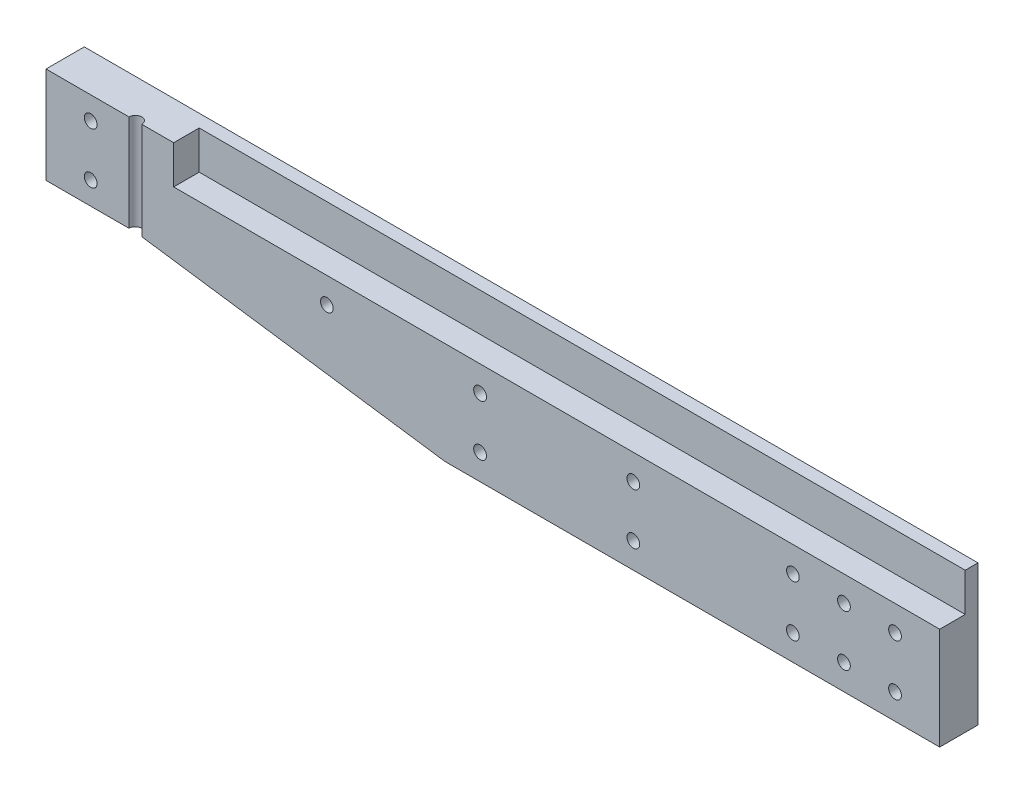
ISO-10303-21;
HEADER;
FILE_DESCRIPTION(('STEP AP214'),'2;1');
FILE_NAME('part.step','',(''),(''),'','','');
FILE_SCHEMA(('AUTOMOTIVE_DESIGN { 1 0 10303 214 1 1 1 1 }'));
ENDSEC;
DATA;
#1=APPLICATION_CONTEXT('core data for automotive mechanical design processes');
#2=APPLICATION_PROTOCOL_DEFINITION('international standard','automotive_design',2000,#1);
#3=PRODUCT_CONTEXT('',#1,'mechanical');
#4=PRODUCT('Part','Part','',(#3));
#5=PRODUCT_RELATED_PRODUCT_CATEGORY('part','',(#4));
#6=PRODUCT_DEFINITION_FORMATION('','',#4);
#7=PRODUCT_DEFINITION_CONTEXT('part definition',#1,'design');
#8=PRODUCT_DEFINITION('design','',#6,#7);
#9=PRODUCT_DEFINITION_SHAPE('','',#8);
#10=(LENGTH_UNIT() NAMED_UNIT(*) SI_UNIT(.MILLI.,.METRE.));
#11=(NAMED_UNIT(*) PLANE_ANGLE_UNIT() SI_UNIT($,.RADIAN.));
#12=(NAMED_UNIT(*) SI_UNIT($,.STERADIAN.) SOLID_ANGLE_UNIT());
#13=UNCERTAINTY_MEASURE_WITH_UNIT(LENGTH_MEASURE(1.E-05),#10,'distance_accuracy_value','');
#14=(GEOMETRIC_REPRESENTATION_CONTEXT(3) GLOBAL_UNCERTAINTY_ASSIGNED_CONTEXT((#13)) GLOBAL_UNIT_ASSIGNED_CONTEXT((#10,
#11,#12)) REPRESENTATION_CONTEXT('',''));
#15=CARTESIAN_POINT('',(0.,0.,0.));
#16=DIRECTION('',(0.,0.,1.));
#17=DIRECTION('',(1.,0.,0.));
#18=AXIS2_PLACEMENT_3D('',#15,#16,#17);
#19=CARTESIAN_POINT('',(-629.274019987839,69.85,-38.1000000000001));
#20=DIRECTION('',(0.,0.,1.));
#21=DIRECTION('',(1.,0.,0.));
#22=AXIS2_PLACEMENT_3D('',#19,#20,#21);
#23=PLANE('',#22);
#24=CARTESIAN_POINT('',(-422.275,33.1531451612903,-38.1));
#25=DIRECTION('',(0.,0.,-1.));
#26=DIRECTION('',(-1.,0.,0.));
#27=AXIS2_PLACEMENT_3D('',#24,#25,#26);
#28=CIRCLE('',#27,3.17499999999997);
#29=CARTESIAN_POINT('',(-425.45,33.1531451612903,-38.1));
#30=VERTEX_POINT('',#29);
#31=EDGE_CURVE('E412',#30,#30,#28,.T.);
#32=ORIENTED_EDGE('',*,*,#31,.F.);
#33=EDGE_LOOP('',(#32));
#34=FACE_BOUND('',#33,.T.);
#35=CARTESIAN_POINT('',(-422.275,58.5531451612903,-38.1));
#36=DIRECTION('',(0.,0.,-1.));
#37=DIRECTION('',(-1.,0.,0.));
#38=AXIS2_PLACEMENT_3D('',#35,#36,#37);
#39=CIRCLE('',#38,3.17499999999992);
#40=CARTESIAN_POINT('',(-425.45,58.5531451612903,-38.1));
#41=VERTEX_POINT('',#40);
#42=EDGE_CURVE('E265',#41,#41,#39,.T.);
#43=ORIENTED_EDGE('',*,*,#42,.F.);
#44=EDGE_LOOP('',(#43));
#45=FACE_BOUND('',#44,.T.);
#46=CARTESIAN_POINT('',(-228.6,38.1,-38.1));
#47=DIRECTION('',(0.,0.,1.));
#48=DIRECTION('',(1.,0.,0.));
#49=AXIS2_PLACEMENT_3D('',#46,#47,#48);
#50=CIRCLE('',#49,3.175);
#51=CARTESIAN_POINT('',(-225.425,38.1,-38.1));
#52=VERTEX_POINT('',#51);
#53=EDGE_CURVE('E163',#52,#52,#50,.T.);
#54=ORIENTED_EDGE('',*,*,#53,.T.);
#55=EDGE_LOOP('',(#54));
#56=FACE_BOUND('',#55,.T.);
#57=CARTESIAN_POINT('',(-228.6,12.7,-38.1));
#58=DIRECTION('',(0.,0.,1.));
#59=DIRECTION('',(1.,0.,0.));
#60=AXIS2_PLACEMENT_3D('',#57,#58,#59);
#61=CIRCLE('',#60,3.175);
#62=CARTESIAN_POINT('',(-225.425,12.7,-38.1));
#63=VERTEX_POINT('',#62);
#64=EDGE_CURVE('E169',#63,#63,#61,.T.);
#65=ORIENTED_EDGE('',*,*,#64,.T.);
#66=EDGE_LOOP('',(#65));
#67=FACE_BOUND('',#66,.T.);
#68=CARTESIAN_POINT('',(-152.4,38.1,-38.1));
#69=DIRECTION('',(0.,0.,1.));
#70=DIRECTION('',(1.,0.,0.));
#71=AXIS2_PLACEMENT_3D('',#68,#69,#70);
#72=CIRCLE('',#71,3.175);
#73=CARTESIAN_POINT('',(-149.225,38.1,-38.1));
#74=VERTEX_POINT('',#73);
#75=EDGE_CURVE('E175',#74,#74,#72,.T.);
#76=ORIENTED_EDGE('',*,*,#75,.T.);
#77=EDGE_LOOP('',(#76));
#78=FACE_BOUND('',#77,.T.);
#79=CARTESIAN_POINT('',(-22.225,38.1,-38.1));
#80=DIRECTION('',(0.,0.,1.));
#81=DIRECTION('',(1.,0.,0.));
#82=AXIS2_PLACEMENT_3D('',#79,#80,#81);
#83=CIRCLE('',#82,3.175);
#84=CARTESIAN_POINT('',(-19.05,38.1,-38.1));
#85=VERTEX_POINT('',#84);
#86=EDGE_CURVE('E181',#85,#85,#83,.T.);
#87=ORIENTED_EDGE('',*,*,#86,.T.);
#88=EDGE_LOOP('',(#87));
#89=FACE_BOUND('',#88,.T.);
#90=CARTESIAN_POINT('',(-47.625,12.7,-38.1));
#91=DIRECTION('',(0.,0.,1.));
#92=DIRECTION('',(1.,0.,0.));
#93=AXIS2_PLACEMENT_3D('',#90,#91,#92);
#94=CIRCLE('',#93,3.175);
#95=CARTESIAN_POINT('',(-44.45,12.7,-38.1));
#96=VERTEX_POINT('',#95);
#97=EDGE_CURVE('E187',#96,#96,#94,.T.);
#98=ORIENTED_EDGE('',*,*,#97,.T.);
#99=EDGE_LOOP('',(#98));
#100=FACE_BOUND('',#99,.T.);
#101=CARTESIAN_POINT('',(-73.025,38.1,-38.1));
#102=DIRECTION('',(0.,0.,1.));
#103=DIRECTION('',(1.,0.,0.));
#104=AXIS2_PLACEMENT_3D('',#101,#102,#103);
#105=CIRCLE('',#104,3.14960000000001);
#106=CARTESIAN_POINT('',(-69.8754,38.1,-38.1));
#107=VERTEX_POINT('',#106);
#108=EDGE_CURVE('E193',#107,#107,#105,.T.);
#109=ORIENTED_EDGE('',*,*,#108,.T.);
#110=EDGE_LOOP('',(#109));
#111=FACE_BOUND('',#110,.T.);
#112=CARTESIAN_POINT('',(-73.025,12.7,-38.1));
#113=DIRECTION('',(0.,0.,1.));
#114=DIRECTION('',(1.,0.,0.));
#115=AXIS2_PLACEMENT_3D('',#112,#113,#114);
#116=CIRCLE('',#115,3.175);
#117=CARTESIAN_POINT('',(-69.85,12.7,-38.1));
#118=VERTEX_POINT('',#117);
#119=EDGE_CURVE('E190',#118,#118,#116,.T.);
#120=ORIENTED_EDGE('',*,*,#119,.T.);
#121=EDGE_LOOP('',(#120));
#122=FACE_BOUND('',#121,.T.);
#123=CARTESIAN_POINT('',(-47.625,38.1,-38.1));
#124=DIRECTION('',(0.,0.,1.));
#125=DIRECTION('',(1.,0.,0.));
#126=AXIS2_PLACEMENT_3D('',#123,#124,#125);
#127=CIRCLE('',#126,3.175);
#128=CARTESIAN_POINT('',(-44.45,38.1,-38.1));
#129=VERTEX_POINT('',#128);
#130=EDGE_CURVE('E184',#129,#129,#127,.T.);
#131=ORIENTED_EDGE('',*,*,#130,.T.);
#132=EDGE_LOOP('',(#131));
#133=FACE_BOUND('',#132,.T.);
#134=CARTESIAN_POINT('',(-22.225,12.7,-38.1));
#135=DIRECTION('',(0.,0.,1.));
#136=DIRECTION('',(1.,0.,0.));
#137=AXIS2_PLACEMENT_3D('',#134,#135,#136);
#138=CIRCLE('',#137,3.175);
#139=CARTESIAN_POINT('',(-19.05,12.7,-38.1));
#140=VERTEX_POINT('',#139);
#141=EDGE_CURVE('E178',#140,#140,#138,.T.);
#142=ORIENTED_EDGE('',*,*,#141,.T.);
#143=EDGE_LOOP('',(#142));
#144=FACE_BOUND('',#143,.T.);
#145=CARTESIAN_POINT('',(-152.4,12.7,-38.1));
#146=DIRECTION('',(0.,0.,1.));
#147=DIRECTION('',(1.,0.,0.));
#148=AXIS2_PLACEMENT_3D('',#145,#146,#147);
#149=CIRCLE('',#148,3.175);
#150=CARTESIAN_POINT('',(-149.225,12.7,-38.1));
#151=VERTEX_POINT('',#150);
#152=EDGE_CURVE('E172',#151,#151,#149,.T.);
#153=ORIENTED_EDGE('',*,*,#152,.T.);
#154=EDGE_LOOP('',(#153));
#155=FACE_BOUND('',#154,.T.);
#156=CARTESIAN_POINT('',(-304.8,38.1,-38.1));
#157=DIRECTION('',(0.,0.,1.));
#158=DIRECTION('',(1.,0.,0.));
#159=AXIS2_PLACEMENT_3D('',#156,#157,#158);
#160=CIRCLE('',#159,3.17499999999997);
#161=CARTESIAN_POINT('',(-301.625,38.1,-38.1));
#162=VERTEX_POINT('',#161);
#163=EDGE_CURVE('E166',#162,#162,#160,.T.);
#164=ORIENTED_EDGE('',*,*,#163,.T.);
#165=EDGE_LOOP('',(#164));
#166=FACE_BOUND('',#165,.T.);
#167=DIRECTION('',(0.,1.,0.));
#168=VECTOR('',#167,1.);
#169=CARTESIAN_POINT('',(-444.5,21.8562903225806,-38.1));
#170=LINE('',#169,#168);
#171=CARTESIAN_POINT('',(-444.5,21.8562903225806,-38.1));
#172=VERTEX_POINT('',#171);
#173=CARTESIAN_POINT('',(-444.5,69.85,-38.1));
#174=VERTEX_POINT('',#173);
#175=EDGE_CURVE('E50',#172,#174,#170,.T.);
#176=ORIENTED_EDGE('',*,*,#175,.T.);
#177=DIRECTION('',(-1.,0.,0.));
#178=VECTOR('',#177,1.);
#179=CARTESIAN_POINT('',(-629.274019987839,69.85,-38.1000000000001));
#180=LINE('',#179,#178);
#181=CARTESIAN_POINT('',(0.,69.85,-38.1));
#182=VERTEX_POINT('',#181);
#183=EDGE_CURVE('E227',#182,#174,#180,.T.);
#184=ORIENTED_EDGE('',*,*,#183,.F.);
#185=DIRECTION('',(0.,-1.,0.));
#186=VECTOR('',#185,1.);
#187=CARTESIAN_POINT('',(0.,69.85,-38.1));
#188=LINE('',#187,#186);
#189=CARTESIAN_POINT('',(0.,0.,-38.1));
#190=VERTEX_POINT('',#189);
#191=EDGE_CURVE('E235',#182,#190,#188,.T.);
#192=ORIENTED_EDGE('',*,*,#191,.T.);
#193=DIRECTION('',(-1.,0.,0.));
#194=VECTOR('',#193,1.);
#195=CARTESIAN_POINT('',(-629.274019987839,0.,-38.1000000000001));
#196=LINE('',#195,#194);
#197=CARTESIAN_POINT('',(-246.0625,0.,-38.1));
#198=VERTEX_POINT('',#197);
#199=EDGE_CURVE('E226',#190,#198,#196,.T.);
#200=ORIENTED_EDGE('',*,*,#199,.T.);
#201=DIRECTION('',(0.990076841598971,-0.14052703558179,0.));
#202=VECTOR('',#201,1.);
#203=CARTESIAN_POINT('',(-631.424826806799,54.696588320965,-38.1000000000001));
#204=LINE('',#203,#202);
#205=CARTESIAN_POINT('',(-400.05,21.8562903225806,-38.1));
#206=VERTEX_POINT('',#205);
#207=EDGE_CURVE('E221',#206,#198,#204,.T.);
#208=ORIENTED_EDGE('',*,*,#207,.F.);
#209=DIRECTION('',(1.,0.,0.));
#210=VECTOR('',#209,1.);
#211=CARTESIAN_POINT('',(-444.5,21.8562903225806,-38.1));
#212=LINE('',#211,#210);
#213=EDGE_CURVE('E211',#172,#206,#212,.T.);
#214=ORIENTED_EDGE('',*,*,#213,.F.);
#215=EDGE_LOOP('',(#176,#184,#192,#200,#208,#214));
#216=FACE_BOUND('',#215,.T.);
#217=ADVANCED_FACE('F35',(#34,#45,#56,#67,#78,#89,#100,#111,#122,#133,#144,#155,#166,#216),#23,.F.);
#218=CARTESIAN_POINT('',(-629.274019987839,69.85,-9.52499999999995));
#219=DIRECTION('',(0.,1.,0.));
#220=DIRECTION('',(0.,0.,1.));
#221=AXIS2_PLACEMENT_3D('',#218,#219,#220);
#222=PLANE('',#221);
#223=ORIENTED_EDGE('',*,*,#183,.T.);
#224=DIRECTION('',(0.,0.,-1.));
#225=VECTOR('',#224,1.);
#226=CARTESIAN_POINT('',(-444.5,69.85,626.540370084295));
#227=LINE('',#226,#225);
#228=CARTESIAN_POINT('',(-444.5,69.85,-19.05));
#229=VERTEX_POINT('',#228);
#230=EDGE_CURVE('E263',#229,#174,#227,.T.);
#231=ORIENTED_EDGE('',*,*,#230,.F.);
#232=DIRECTION('',(-1.,0.,0.));
#233=VECTOR('',#232,1.);
#234=CARTESIAN_POINT('',(-629.274019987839,69.85,-19.05));
#235=LINE('',#234,#233);
#236=CARTESIAN_POINT('',(-403.225,69.85,-19.05));
#237=VERTEX_POINT('',#236);
#238=EDGE_CURVE('E229',#237,#229,#235,.T.);
#239=ORIENTED_EDGE('',*,*,#238,.F.);
#240=CARTESIAN_POINT('',(-400.05,69.85,-19.05));
#241=DIRECTION('',(0.,1.,0.));
#242=DIRECTION('',(0.,0.,1.));
#243=AXIS2_PLACEMENT_3D('',#240,#241,#242);
#244=CIRCLE('',#243,3.17499999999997);
#245=CARTESIAN_POINT('',(-396.875,69.85,-19.05));
#246=VERTEX_POINT('',#245);
#247=EDGE_CURVE('E138',#246,#237,#244,.T.);
#248=ORIENTED_EDGE('',*,*,#247,.F.);
#249=DIRECTION('',(-1.,0.,0.));
#250=VECTOR('',#249,1.);
#251=CARTESIAN_POINT('',(-629.274019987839,69.85,-19.05));
#252=LINE('',#251,#250);
#253=CARTESIAN_POINT('',(-381.,69.85,-19.05));
#254=VERTEX_POINT('',#253);
#255=EDGE_CURVE('E134',#254,#246,#252,.T.);
#256=ORIENTED_EDGE('',*,*,#255,.F.);
#257=DIRECTION('',(0.,0.,1.));
#258=VECTOR('',#257,1.);
#259=CARTESIAN_POINT('',(-381.,69.85,-19.05));
#260=LINE('',#259,#258);
#261=CARTESIAN_POINT('',(-381.,69.85,-31.75));
#262=VERTEX_POINT('',#261);
#263=EDGE_CURVE('E118',#262,#254,#260,.T.);
#264=ORIENTED_EDGE('',*,*,#263,.F.);
#265=DIRECTION('',(1.,0.,0.));
#266=VECTOR('',#265,1.);
#267=CARTESIAN_POINT('',(-381.,69.85,-31.75));
#268=LINE('',#267,#266);
#269=CARTESIAN_POINT('',(0.,69.85,-31.75));
#270=VERTEX_POINT('',#269);
#271=EDGE_CURVE('E219',#262,#270,#268,.T.);
#272=ORIENTED_EDGE('',*,*,#271,.T.);
#273=DIRECTION('',(0.,0.,1.));
#274=VECTOR('',#273,1.);
#275=CARTESIAN_POINT('',(0.,69.85,-28.575));
#276=LINE('',#275,#274);
#277=EDGE_CURVE('E232',#182,#270,#276,.T.);
#278=ORIENTED_EDGE('',*,*,#277,.F.);
#279=EDGE_LOOP('',(#223,#231,#239,#248,#256,#264,#272,#278));
#280=FACE_BOUND('',#279,.T.);
#281=ADVANCED_FACE('F135',(#280),#222,.T.);
#282=CARTESIAN_POINT('',(-629.274019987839,69.85,-19.05));
#283=DIRECTION('',(0.,0.,1.));
#284=DIRECTION('',(1.,0.,0.));
#285=AXIS2_PLACEMENT_3D('',#282,#283,#284);
#286=PLANE('',#285);
#287=CARTESIAN_POINT('',(-422.275,33.1531451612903,-19.05));
#288=DIRECTION('',(0.,0.,1.));
#289=DIRECTION('',(1.,0.,0.));
#290=AXIS2_PLACEMENT_3D('',#287,#288,#289);
#291=CIRCLE('',#290,3.17499999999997);
#292=CARTESIAN_POINT('',(-419.1,33.1531451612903,-19.05));
#293=VERTEX_POINT('',#292);
#294=EDGE_CURVE('E409',#293,#293,#291,.F.);
#295=ORIENTED_EDGE('',*,*,#294,.T.);
#296=EDGE_LOOP('',(#295));
#297=FACE_BOUND('',#296,.T.);
#298=CARTESIAN_POINT('',(-422.275,58.5531451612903,-19.05));
#299=DIRECTION('',(0.,0.,1.));
#300=DIRECTION('',(1.,0.,0.));
#301=AXIS2_PLACEMENT_3D('',#298,#299,#300);
#302=CIRCLE('',#301,3.17499999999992);
#303=CARTESIAN_POINT('',(-419.1,58.5531451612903,-19.05));
#304=VERTEX_POINT('',#303);
#305=EDGE_CURVE('E271',#304,#304,#302,.F.);
#306=ORIENTED_EDGE('',*,*,#305,.T.);
#307=EDGE_LOOP('',(#306));
#308=FACE_BOUND('',#307,.T.);
#309=ORIENTED_EDGE('',*,*,#238,.T.);
#310=DIRECTION('',(0.,-1.,0.));
#311=VECTOR('',#310,1.);
#312=CARTESIAN_POINT('',(-444.5,21.8562903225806,-19.05));
#313=LINE('',#312,#311);
#314=CARTESIAN_POINT('',(-444.5,21.8562903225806,-19.05));
#315=VERTEX_POINT('',#314);
#316=EDGE_CURVE('E58',#229,#315,#313,.T.);
#317=ORIENTED_EDGE('',*,*,#316,.T.);
#318=DIRECTION('',(1.,0.,0.));
#319=VECTOR('',#318,1.);
#320=CARTESIAN_POINT('',(-444.5,21.8562903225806,-19.05));
#321=LINE('',#320,#319);
#322=CARTESIAN_POINT('',(-403.225,21.8562903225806,-19.05));
#323=VERTEX_POINT('',#322);
#324=EDGE_CURVE('E207',#315,#323,#321,.T.);
#325=ORIENTED_EDGE('',*,*,#324,.T.);
#326=DIRECTION('',(0.,1.,0.));
#327=VECTOR('',#326,1.);
#328=CARTESIAN_POINT('',(-403.225,-0.00100000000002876,-19.05));
#329=LINE('',#328,#327);
#330=EDGE_CURVE('E196',#237,#323,#329,.F.);
#331=ORIENTED_EDGE('',*,*,#330,.F.);
#332=EDGE_LOOP('',(#309,#317,#325,#331));
#333=FACE_BOUND('',#332,.T.);
#334=ADVANCED_FACE('F326',(#297,#308,#333),#286,.T.);
#335=CARTESIAN_POINT('',(-492.125,34.925,621.777870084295));
#336=DIRECTION('',(0.14052703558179,0.990076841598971,0.));
#337=DIRECTION('',(-0.990076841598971,0.14052703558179,0.));
#338=AXIS2_PLACEMENT_3D('',#335,#336,#337);
#339=PLANE('',#338);
#340=DIRECTION('',(0.,0.,-1.));
#341=VECTOR('',#340,1.);
#342=CARTESIAN_POINT('',(-246.0625,0.,-9.52499999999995));
#343=LINE('',#342,#341);
#344=CARTESIAN_POINT('',(-246.0625,0.,-19.05));
#345=VERTEX_POINT('',#344);
#346=EDGE_CURVE('E11',#345,#198,#343,.T.);
#347=ORIENTED_EDGE('',*,*,#346,.F.);
#348=DIRECTION('',(-0.990076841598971,0.14052703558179,0.));
#349=VECTOR('',#348,1.);
#350=CARTESIAN_POINT('',(-492.125,34.925,-19.05));
#351=LINE('',#350,#349);
#352=CARTESIAN_POINT('',(-396.875,21.4056451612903,-19.05));
#353=VERTEX_POINT('',#352);
#354=EDGE_CURVE('E161',#345,#353,#351,.T.);
#355=ORIENTED_EDGE('',*,*,#354,.T.);
#356=CARTESIAN_POINT('',(-400.05,21.8562903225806,-19.05));
#357=DIRECTION('',(0.14052703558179,0.990076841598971,0.));
#358=DIRECTION('',(-0.990076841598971,0.14052703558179,0.));
#359=AXIS2_PLACEMENT_3D('',#356,#357,#358);
#360=ELLIPSE('',#359,3.20682180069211,3.17499999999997);
#361=CARTESIAN_POINT('',(-400.05,21.8562903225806,-22.225));
#362=VERTEX_POINT('',#361);
#363=EDGE_CURVE('E241',#362,#353,#360,.F.);
#364=ORIENTED_EDGE('',*,*,#363,.F.);
#365=DIRECTION('',(0.,0.,-1.));
#366=VECTOR('',#365,1.);
#367=CARTESIAN_POINT('',(-400.05,21.8562903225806,-38.1));
#368=LINE('',#367,#366);
#369=EDGE_CURVE('E201',#362,#206,#368,.T.);
#370=ORIENTED_EDGE('',*,*,#369,.T.);
#371=ORIENTED_EDGE('',*,*,#207,.T.);
#372=EDGE_LOOP('',(#347,#355,#364,#370,#371));
#373=FACE_BOUND('',#372,.T.);
#374=ADVANCED_FACE('F256',(#373),#339,.F.);
#375=CARTESIAN_POINT('',(-444.5,21.8562903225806,-38.1));
#376=DIRECTION('',(0.,-1.,0.));
#377=DIRECTION('',(0.,0.,-1.));
#378=AXIS2_PLACEMENT_3D('',#375,#376,#377);
#379=PLANE('',#378);
#380=ORIENTED_EDGE('',*,*,#369,.F.);
#381=CARTESIAN_POINT('',(-400.05,21.8562903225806,-19.05));
#382=DIRECTION('',(0.,-1.,0.));
#383=DIRECTION('',(0.,0.,-1.));
#384=AXIS2_PLACEMENT_3D('',#381,#382,#383);
#385=CIRCLE('',#384,3.17499999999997);
#386=EDGE_CURVE('E198',#323,#362,#385,.T.);
#387=ORIENTED_EDGE('',*,*,#386,.F.);
#388=ORIENTED_EDGE('',*,*,#324,.F.);
#389=DIRECTION('',(0.,0.,-1.));
#390=VECTOR('',#389,1.);
#391=CARTESIAN_POINT('',(-444.5,21.8562903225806,-38.1));
#392=LINE('',#391,#390);
#393=EDGE_CURVE('E203',#315,#172,#392,.T.);
#394=ORIENTED_EDGE('',*,*,#393,.T.);
#395=ORIENTED_EDGE('',*,*,#213,.T.);
#396=EDGE_LOOP('',(#380,#387,#388,#394,#395));
#397=FACE_BOUND('',#396,.T.);
#398=ADVANCED_FACE('F259',(#397),#379,.T.);
#399=CARTESIAN_POINT('',(0.,69.85,-9.52499999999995));
#400=DIRECTION('',(-1.,0.,0.));
#401=DIRECTION('',(0.,0.,1.));
#402=AXIS2_PLACEMENT_3D('',#399,#400,#401);
#403=PLANE('',#402);
#404=DIRECTION('',(0.,0.,-1.));
#405=VECTOR('',#404,1.);
#406=CARTESIAN_POINT('',(0.,50.8,-19.05));
#407=LINE('',#406,#405);
#408=CARTESIAN_POINT('',(0.,50.8,-19.05));
#409=VERTEX_POINT('',#408);
#410=CARTESIAN_POINT('',(0.,50.8,-31.75));
#411=VERTEX_POINT('',#410);
#412=EDGE_CURVE('E130',#409,#411,#407,.T.);
#413=ORIENTED_EDGE('',*,*,#412,.F.);
#414=DIRECTION('',(0.,-1.,0.));
#415=VECTOR('',#414,1.);
#416=CARTESIAN_POINT('',(0.,69.85,-19.05));
#417=LINE('',#416,#415);
#418=CARTESIAN_POINT('',(0.,0.,-19.05));
#419=VERTEX_POINT('',#418);
#420=EDGE_CURVE('E142',#409,#419,#417,.T.);
#421=ORIENTED_EDGE('',*,*,#420,.T.);
#422=DIRECTION('',(0.,0.,-1.));
#423=VECTOR('',#422,1.);
#424=CARTESIAN_POINT('',(0.,0.,-9.52499999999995));
#425=LINE('',#424,#423);
#426=EDGE_CURVE('E43',#419,#190,#425,.T.);
#427=ORIENTED_EDGE('',*,*,#426,.T.);
#428=ORIENTED_EDGE('',*,*,#191,.F.);
#429=ORIENTED_EDGE('',*,*,#277,.T.);
#430=DIRECTION('',(0.,-1.,0.));
#431=VECTOR('',#430,1.);
#432=CARTESIAN_POINT('',(0.,69.85,-31.75));
#433=LINE('',#432,#431);
#434=EDGE_CURVE('E214',#270,#411,#433,.T.);
#435=ORIENTED_EDGE('',*,*,#434,.T.);
#436=EDGE_LOOP('',(#413,#421,#427,#428,#429,#435));
#437=FACE_BOUND('',#436,.T.);
#438=ADVANCED_FACE('F37',(#437),#403,.F.);
#439=CARTESIAN_POINT('',(-629.274019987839,0.,-9.52499999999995));
#440=DIRECTION('',(0.,1.,0.));
#441=DIRECTION('',(0.,0.,1.));
#442=AXIS2_PLACEMENT_3D('',#439,#440,#441);
#443=PLANE('',#442);
#444=ORIENTED_EDGE('',*,*,#426,.F.);
#445=DIRECTION('',(-1.,0.,0.));
#446=VECTOR('',#445,1.);
#447=CARTESIAN_POINT('',(-629.274019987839,0.,-19.05));
#448=LINE('',#447,#446);
#449=EDGE_CURVE('E159',#419,#345,#448,.T.);
#450=ORIENTED_EDGE('',*,*,#449,.T.);
#451=ORIENTED_EDGE('',*,*,#346,.T.);
#452=ORIENTED_EDGE('',*,*,#199,.F.);
#453=EDGE_LOOP('',(#444,#450,#451,#452));
#454=FACE_BOUND('',#453,.T.);
#455=ADVANCED_FACE('F253',(#454),#443,.F.);
#456=CARTESIAN_POINT('',(-400.05,-0.00100000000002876,-19.05));
#457=DIRECTION('',(0.,1.,0.));
#458=DIRECTION('',(0.,0.,1.));
#459=AXIS2_PLACEMENT_3D('',#456,#457,#458);
#460=CYLINDRICAL_SURFACE('',#459,3.17499999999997);
#461=ORIENTED_EDGE('',*,*,#247,.T.);
#462=ORIENTED_EDGE('',*,*,#330,.T.);
#463=ORIENTED_EDGE('',*,*,#386,.T.);
#464=ORIENTED_EDGE('',*,*,#363,.T.);
#465=DIRECTION('',(0.,1.,0.));
#466=VECTOR('',#465,1.);
#467=CARTESIAN_POINT('',(-396.875,-0.00100000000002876,-19.05));
#468=LINE('',#467,#466);
#469=EDGE_CURVE('E141',#353,#246,#468,.T.);
#470=ORIENTED_EDGE('',*,*,#469,.T.);
#471=EDGE_LOOP('',(#461,#462,#463,#464,#470));
#472=FACE_BOUND('',#471,.T.);
#473=ADVANCED_FACE('F375',(#472),#460,.F.);
#474=CARTESIAN_POINT('',(-381.,50.8,-19.05));
#475=DIRECTION('',(0.,-1.,0.));
#476=DIRECTION('',(0.,0.,-1.));
#477=AXIS2_PLACEMENT_3D('',#474,#475,#476);
#478=PLANE('',#477);
#479=DIRECTION('',(0.,0.,-1.));
#480=VECTOR('',#479,1.);
#481=CARTESIAN_POINT('',(-381.,50.8,-19.05));
#482=LINE('',#481,#480);
#483=CARTESIAN_POINT('',(-381.,50.8,-19.05));
#484=VERTEX_POINT('',#483);
#485=CARTESIAN_POINT('',(-381.,50.8,-31.75));
#486=VERTEX_POINT('',#485);
#487=EDGE_CURVE('E129',#484,#486,#482,.T.);
#488=ORIENTED_EDGE('',*,*,#487,.F.);
#489=DIRECTION('',(1.,0.,0.));
#490=VECTOR('',#489,1.);
#491=CARTESIAN_POINT('',(-381.,50.8,-19.05));
#492=LINE('',#491,#490);
#493=EDGE_CURVE('E148',#484,#409,#492,.T.);
#494=ORIENTED_EDGE('',*,*,#493,.T.);
#495=ORIENTED_EDGE('',*,*,#412,.T.);
#496=DIRECTION('',(1.,0.,0.));
#497=VECTOR('',#496,1.);
#498=CARTESIAN_POINT('',(-381.,50.8,-31.75));
#499=LINE('',#498,#497);
#500=EDGE_CURVE('E216',#486,#411,#499,.T.);
#501=ORIENTED_EDGE('',*,*,#500,.F.);
#502=EDGE_LOOP('',(#488,#494,#495,#501));
#503=FACE_BOUND('',#502,.T.);
#504=ADVANCED_FACE('F378',(#503),#478,.F.);
#505=CARTESIAN_POINT('',(-381.,69.85,-6.35));
#506=DIRECTION('',(1.,0.,0.));
#507=DIRECTION('',(0.,0.,-1.));
#508=AXIS2_PLACEMENT_3D('',#505,#506,#507);
#509=PLANE('',#508);
#510=DIRECTION('',(0.,1.,0.));
#511=VECTOR('',#510,1.);
#512=CARTESIAN_POINT('',(-381.,69.85,-19.05));
#513=LINE('',#512,#511);
#514=EDGE_CURVE('E122',#484,#254,#513,.T.);
#515=ORIENTED_EDGE('',*,*,#514,.F.);
#516=ORIENTED_EDGE('',*,*,#487,.T.);
#517=DIRECTION('',(0.,-1.,0.));
#518=VECTOR('',#517,1.);
#519=CARTESIAN_POINT('',(-381.,69.85,-31.75));
#520=LINE('',#519,#518);
#521=EDGE_CURVE('E125',#262,#486,#520,.T.);
#522=ORIENTED_EDGE('',*,*,#521,.F.);
#523=ORIENTED_EDGE('',*,*,#263,.T.);
#524=EDGE_LOOP('',(#515,#516,#522,#523));
#525=FACE_BOUND('',#524,.T.);
#526=ADVANCED_FACE('F120',(#525),#509,.T.);
#527=CARTESIAN_POINT('',(-73.025,38.1,-19.051));
#528=DIRECTION('',(0.,0.,1.));
#529=DIRECTION('',(1.,0.,0.));
#530=AXIS2_PLACEMENT_3D('',#527,#528,#529);
#531=CYLINDRICAL_SURFACE('',#530,3.14960000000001);
#532=CARTESIAN_POINT('',(-73.025,38.1,-19.05));
#533=DIRECTION('',(0.,0.,-1.));
#534=DIRECTION('',(-1.,0.,0.));
#535=AXIS2_PLACEMENT_3D('',#532,#533,#534);
#536=CIRCLE('',#535,3.14960000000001);
#537=CARTESIAN_POINT('',(-76.1746,38.1,-19.05));
#538=VERTEX_POINT('',#537);
#539=EDGE_CURVE('E149',#538,#538,#536,.F.);
#540=ORIENTED_EDGE('',*,*,#539,.T.);
#541=EDGE_LOOP('',(#540));
#542=FACE_BOUND('',#541,.T.);
#543=ORIENTED_EDGE('',*,*,#108,.F.);
#544=EDGE_LOOP('',(#543));
#545=FACE_BOUND('',#544,.T.);
#546=ADVANCED_FACE('F371',(#542,#545),#531,.F.);
#547=CARTESIAN_POINT('',(-73.025,12.7,-19.051));
#548=DIRECTION('',(0.,0.,1.));
#549=DIRECTION('',(1.,0.,0.));
#550=AXIS2_PLACEMENT_3D('',#547,#548,#549);
#551=CYLINDRICAL_SURFACE('',#550,3.175);
#552=CARTESIAN_POINT('',(-73.025,12.7,-19.05));
#553=DIRECTION('',(0.,0.,-1.));
#554=DIRECTION('',(-1.,0.,0.));
#555=AXIS2_PLACEMENT_3D('',#552,#553,#554);
#556=CIRCLE('',#555,3.175);
#557=CARTESIAN_POINT('',(-76.2,12.7,-19.05));
#558=VERTEX_POINT('',#557);
#559=EDGE_CURVE('E153',#558,#558,#556,.F.);
#560=ORIENTED_EDGE('',*,*,#559,.T.);
#561=EDGE_LOOP('',(#560));
#562=FACE_BOUND('',#561,.T.);
#563=ORIENTED_EDGE('',*,*,#119,.F.);
#564=EDGE_LOOP('',(#563));
#565=FACE_BOUND('',#564,.T.);
#566=ADVANCED_FACE('F300',(#562,#565),#551,.F.);
#567=CARTESIAN_POINT('',(-47.625,12.7,-19.051));
#568=DIRECTION('',(0.,0.,1.));
#569=DIRECTION('',(1.,0.,0.));
#570=AXIS2_PLACEMENT_3D('',#567,#568,#569);
#571=CYLINDRICAL_SURFACE('',#570,3.175);
#572=CARTESIAN_POINT('',(-47.625,12.7,-19.05));
#573=DIRECTION('',(0.,0.,-1.));
#574=DIRECTION('',(-1.,0.,0.));
#575=AXIS2_PLACEMENT_3D('',#572,#573,#574);
#576=CIRCLE('',#575,3.175);
#577=CARTESIAN_POINT('',(-50.8,12.7,-19.05));
#578=VERTEX_POINT('',#577);
#579=EDGE_CURVE('E295',#578,#578,#576,.F.);
#580=ORIENTED_EDGE('',*,*,#579,.T.);
#581=EDGE_LOOP('',(#580));
#582=FACE_BOUND('',#581,.T.);
#583=ORIENTED_EDGE('',*,*,#97,.F.);
#584=EDGE_LOOP('',(#583));
#585=FACE_BOUND('',#584,.T.);
#586=ADVANCED_FACE('F364',(#582,#585),#571,.F.);
#587=CARTESIAN_POINT('',(-47.625,38.1,-19.051));
#588=DIRECTION('',(0.,0.,1.));
#589=DIRECTION('',(1.,0.,0.));
#590=AXIS2_PLACEMENT_3D('',#587,#588,#589);
#591=CYLINDRICAL_SURFACE('',#590,3.175);
#592=CARTESIAN_POINT('',(-47.625,38.1,-19.05));
#593=DIRECTION('',(0.,0.,-1.));
#594=DIRECTION('',(-1.,0.,0.));
#595=AXIS2_PLACEMENT_3D('',#592,#593,#594);
#596=CIRCLE('',#595,3.175);
#597=CARTESIAN_POINT('',(-50.8,38.1,-19.05));
#598=VERTEX_POINT('',#597);
#599=EDGE_CURVE('E292',#598,#598,#596,.F.);
#600=ORIENTED_EDGE('',*,*,#599,.T.);
#601=EDGE_LOOP('',(#600));
#602=FACE_BOUND('',#601,.T.);
#603=ORIENTED_EDGE('',*,*,#130,.F.);
#604=EDGE_LOOP('',(#603));
#605=FACE_BOUND('',#604,.T.);
#606=ADVANCED_FACE('F360',(#602,#605),#591,.F.);
#607=CARTESIAN_POINT('',(-22.225,38.1,-19.051));
#608=DIRECTION('',(0.,0.,1.));
#609=DIRECTION('',(1.,0.,0.));
#610=AXIS2_PLACEMENT_3D('',#607,#608,#609);
#611=CYLINDRICAL_SURFACE('',#610,3.175);
#612=CARTESIAN_POINT('',(-22.225,38.1,-19.05));
#613=DIRECTION('',(0.,0.,-1.));
#614=DIRECTION('',(-1.,0.,0.));
#615=AXIS2_PLACEMENT_3D('',#612,#613,#614);
#616=CIRCLE('',#615,3.175);
#617=CARTESIAN_POINT('',(-25.4,38.1,-19.05));
#618=VERTEX_POINT('',#617);
#619=EDGE_CURVE('E289',#618,#618,#616,.F.);
#620=ORIENTED_EDGE('',*,*,#619,.T.);
#621=EDGE_LOOP('',(#620));
#622=FACE_BOUND('',#621,.T.);
#623=ORIENTED_EDGE('',*,*,#86,.F.);
#624=EDGE_LOOP('',(#623));
#625=FACE_BOUND('',#624,.T.);
#626=ADVANCED_FACE('F356',(#622,#625),#611,.F.);
#627=CARTESIAN_POINT('',(-22.225,12.7,-19.051));
#628=DIRECTION('',(0.,0.,1.));
#629=DIRECTION('',(1.,0.,0.));
#630=AXIS2_PLACEMENT_3D('',#627,#628,#629);
#631=CYLINDRICAL_SURFACE('',#630,3.175);
#632=CARTESIAN_POINT('',(-22.225,12.7,-19.05));
#633=DIRECTION('',(0.,0.,-1.));
#634=DIRECTION('',(-1.,0.,0.));
#635=AXIS2_PLACEMENT_3D('',#632,#633,#634);
#636=CIRCLE('',#635,3.175);
#637=CARTESIAN_POINT('',(-25.4,12.7,-19.05));
#638=VERTEX_POINT('',#637);
#639=EDGE_CURVE('E286',#638,#638,#636,.F.);
#640=ORIENTED_EDGE('',*,*,#639,.T.);
#641=EDGE_LOOP('',(#640));
#642=FACE_BOUND('',#641,.T.);
#643=ORIENTED_EDGE('',*,*,#141,.F.);
#644=EDGE_LOOP('',(#643));
#645=FACE_BOUND('',#644,.T.);
#646=ADVANCED_FACE('F352',(#642,#645),#631,.F.);
#647=CARTESIAN_POINT('',(-152.4,38.1,-19.051));
#648=DIRECTION('',(0.,0.,1.));
#649=DIRECTION('',(1.,0.,0.));
#650=AXIS2_PLACEMENT_3D('',#647,#648,#649);
#651=CYLINDRICAL_SURFACE('',#650,3.175);
#652=CARTESIAN_POINT('',(-152.4,38.1,-19.05));
#653=DIRECTION('',(0.,0.,-1.));
#654=DIRECTION('',(-1.,0.,0.));
#655=AXIS2_PLACEMENT_3D('',#652,#653,#654);
#656=CIRCLE('',#655,3.175);
#657=CARTESIAN_POINT('',(-155.575,38.1,-19.05));
#658=VERTEX_POINT('',#657);
#659=EDGE_CURVE('E283',#658,#658,#656,.F.);
#660=ORIENTED_EDGE('',*,*,#659,.T.);
#661=EDGE_LOOP('',(#660));
#662=FACE_BOUND('',#661,.T.);
#663=ORIENTED_EDGE('',*,*,#75,.F.);
#664=EDGE_LOOP('',(#663));
#665=FACE_BOUND('',#664,.T.);
#666=ADVANCED_FACE('F348',(#662,#665),#651,.F.);
#667=CARTESIAN_POINT('',(-152.4,12.7,-19.051));
#668=DIRECTION('',(0.,0.,1.));
#669=DIRECTION('',(1.,0.,0.));
#670=AXIS2_PLACEMENT_3D('',#667,#668,#669);
#671=CYLINDRICAL_SURFACE('',#670,3.175);
#672=CARTESIAN_POINT('',(-152.4,12.7,-19.05));
#673=DIRECTION('',(0.,0.,-1.));
#674=DIRECTION('',(-1.,0.,0.));
#675=AXIS2_PLACEMENT_3D('',#672,#673,#674);
#676=CIRCLE('',#675,3.175);
#677=CARTESIAN_POINT('',(-155.575,12.7,-19.05));
#678=VERTEX_POINT('',#677);
#679=EDGE_CURVE('E280',#678,#678,#676,.F.);
#680=ORIENTED_EDGE('',*,*,#679,.T.);
#681=EDGE_LOOP('',(#680));
#682=FACE_BOUND('',#681,.T.);
#683=ORIENTED_EDGE('',*,*,#152,.F.);
#684=EDGE_LOOP('',(#683));
#685=FACE_BOUND('',#684,.T.);
#686=ADVANCED_FACE('F344',(#682,#685),#671,.F.);
#687=CARTESIAN_POINT('',(-228.6,12.7,-19.051));
#688=DIRECTION('',(0.,0.,1.));
#689=DIRECTION('',(1.,0.,0.));
#690=AXIS2_PLACEMENT_3D('',#687,#688,#689);
#691=CYLINDRICAL_SURFACE('',#690,3.175);
#692=CARTESIAN_POINT('',(-228.6,12.7,-19.05));
#693=DIRECTION('',(0.,0.,-1.));
#694=DIRECTION('',(-1.,0.,0.));
#695=AXIS2_PLACEMENT_3D('',#692,#693,#694);
#696=CIRCLE('',#695,3.175);
#697=CARTESIAN_POINT('',(-231.775,12.7,-19.05));
#698=VERTEX_POINT('',#697);
#699=EDGE_CURVE('E277',#698,#698,#696,.F.);
#700=ORIENTED_EDGE('',*,*,#699,.T.);
#701=EDGE_LOOP('',(#700));
#702=FACE_BOUND('',#701,.T.);
#703=ORIENTED_EDGE('',*,*,#64,.F.);
#704=EDGE_LOOP('',(#703));
#705=FACE_BOUND('',#704,.T.);
#706=ADVANCED_FACE('F340',(#702,#705),#691,.F.);
#707=CARTESIAN_POINT('',(-304.8,38.1,-19.051));
#708=DIRECTION('',(0.,0.,1.));
#709=DIRECTION('',(1.,0.,0.));
#710=AXIS2_PLACEMENT_3D('',#707,#708,#709);
#711=CYLINDRICAL_SURFACE('',#710,3.17499999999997);
#712=CARTESIAN_POINT('',(-304.8,38.1,-19.05));
#713=DIRECTION('',(0.,0.,-1.));
#714=DIRECTION('',(-1.,0.,0.));
#715=AXIS2_PLACEMENT_3D('',#712,#713,#714);
#716=CIRCLE('',#715,3.17499999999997);
#717=CARTESIAN_POINT('',(-307.975,38.1,-19.05));
#718=VERTEX_POINT('',#717);
#719=EDGE_CURVE('E268',#718,#718,#716,.F.);
#720=ORIENTED_EDGE('',*,*,#719,.T.);
#721=EDGE_LOOP('',(#720));
#722=FACE_BOUND('',#721,.T.);
#723=ORIENTED_EDGE('',*,*,#163,.F.);
#724=EDGE_LOOP('',(#723));
#725=FACE_BOUND('',#724,.T.);
#726=ADVANCED_FACE('F336',(#722,#725),#711,.F.);
#727=CARTESIAN_POINT('',(-228.6,38.1,-19.051));
#728=DIRECTION('',(0.,0.,1.));
#729=DIRECTION('',(1.,0.,0.));
#730=AXIS2_PLACEMENT_3D('',#727,#728,#729);
#731=CYLINDRICAL_SURFACE('',#730,3.175);
#732=CARTESIAN_POINT('',(-228.6,38.1,-19.05));
#733=DIRECTION('',(0.,0.,-1.));
#734=DIRECTION('',(-1.,0.,0.));
#735=AXIS2_PLACEMENT_3D('',#732,#733,#734);
#736=CIRCLE('',#735,3.175);
#737=CARTESIAN_POINT('',(-231.775,38.1,-19.05));
#738=VERTEX_POINT('',#737);
#739=EDGE_CURVE('E264',#738,#738,#736,.F.);
#740=ORIENTED_EDGE('',*,*,#739,.T.);
#741=EDGE_LOOP('',(#740));
#742=FACE_BOUND('',#741,.T.);
#743=ORIENTED_EDGE('',*,*,#53,.F.);
#744=EDGE_LOOP('',(#743));
#745=FACE_BOUND('',#744,.T.);
#746=ADVANCED_FACE('F333',(#742,#745),#731,.F.);
#747=CARTESIAN_POINT('',(-381.,69.85,-31.75));
#748=DIRECTION('',(0.,0.,1.));
#749=DIRECTION('',(0.,-1.,0.));
#750=AXIS2_PLACEMENT_3D('',#747,#748,#749);
#751=PLANE('',#750);
#752=ORIENTED_EDGE('',*,*,#434,.F.);
#753=ORIENTED_EDGE('',*,*,#271,.F.);
#754=ORIENTED_EDGE('',*,*,#521,.T.);
#755=ORIENTED_EDGE('',*,*,#500,.T.);
#756=EDGE_LOOP('',(#752,#753,#754,#755));
#757=FACE_BOUND('',#756,.T.);
#758=ADVANCED_FACE('F314',(#757),#751,.T.);
#759=CARTESIAN_POINT('',(-444.5,69.85,-38.1));
#760=DIRECTION('',(-1.,0.,0.));
#761=DIRECTION('',(0.,0.,-1.));
#762=AXIS2_PLACEMENT_3D('',#759,#760,#761);
#763=PLANE('',#762);
#764=ORIENTED_EDGE('',*,*,#316,.F.);
#765=ORIENTED_EDGE('',*,*,#230,.T.);
#766=ORIENTED_EDGE('',*,*,#175,.F.);
#767=ORIENTED_EDGE('',*,*,#393,.F.);
#768=EDGE_LOOP('',(#764,#765,#766,#767));
#769=FACE_BOUND('',#768,.T.);
#770=ADVANCED_FACE('F262',(#769),#763,.T.);
#771=CARTESIAN_POINT('',(-444.5,692.994305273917,-19.05));
#772=DIRECTION('',(0.,0.,-1.));
#773=DIRECTION('',(-1.,0.,0.));
#774=AXIS2_PLACEMENT_3D('',#771,#772,#773);
#775=PLANE('',#774);
#776=ORIENTED_EDGE('',*,*,#539,.F.);
#777=EDGE_LOOP('',(#776));
#778=FACE_BOUND('',#777,.T.);
#779=ORIENTED_EDGE('',*,*,#579,.F.);
#780=EDGE_LOOP('',(#779));
#781=FACE_BOUND('',#780,.T.);
#782=ORIENTED_EDGE('',*,*,#619,.F.);
#783=EDGE_LOOP('',(#782));
#784=FACE_BOUND('',#783,.T.);
#785=ORIENTED_EDGE('',*,*,#659,.F.);
#786=EDGE_LOOP('',(#785));
#787=FACE_BOUND('',#786,.T.);
#788=ORIENTED_EDGE('',*,*,#699,.F.);
#789=EDGE_LOOP('',(#788));
#790=FACE_BOUND('',#789,.T.);
#791=ORIENTED_EDGE('',*,*,#739,.F.);
#792=EDGE_LOOP('',(#791));
#793=FACE_BOUND('',#792,.T.);
#794=ORIENTED_EDGE('',*,*,#719,.F.);
#795=EDGE_LOOP('',(#794));
#796=FACE_BOUND('',#795,.T.);
#797=ORIENTED_EDGE('',*,*,#679,.F.);
#798=EDGE_LOOP('',(#797));
#799=FACE_BOUND('',#798,.T.);
#800=ORIENTED_EDGE('',*,*,#639,.F.);
#801=EDGE_LOOP('',(#800));
#802=FACE_BOUND('',#801,.T.);
#803=ORIENTED_EDGE('',*,*,#599,.F.);
#804=EDGE_LOOP('',(#803));
#805=FACE_BOUND('',#804,.T.);
#806=ORIENTED_EDGE('',*,*,#559,.F.);
#807=EDGE_LOOP('',(#806));
#808=FACE_BOUND('',#807,.T.);
#809=ORIENTED_EDGE('',*,*,#354,.F.);
#810=ORIENTED_EDGE('',*,*,#449,.F.);
#811=ORIENTED_EDGE('',*,*,#420,.F.);
#812=ORIENTED_EDGE('',*,*,#493,.F.);
#813=ORIENTED_EDGE('',*,*,#514,.T.);
#814=ORIENTED_EDGE('',*,*,#255,.T.);
#815=ORIENTED_EDGE('',*,*,#469,.F.);
#816=EDGE_LOOP('',(#809,#810,#811,#812,#813,#814,#815));
#817=FACE_BOUND('',#816,.T.);
#818=ADVANCED_FACE('F146',(#778,#781,#784,#787,#790,#793,#796,#799,#802,#805,#808,#817),#775,.F.);
#819=CARTESIAN_POINT('',(-422.275,58.5531451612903,-19.049));
#820=DIRECTION('',(0.,0.,-1.));
#821=DIRECTION('',(-1.,0.,0.));
#822=AXIS2_PLACEMENT_3D('',#819,#820,#821);
#823=CYLINDRICAL_SURFACE('',#822,3.17499999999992);
#824=ORIENTED_EDGE('',*,*,#305,.F.);
#825=EDGE_LOOP('',(#824));
#826=FACE_BOUND('',#825,.T.);
#827=ORIENTED_EDGE('',*,*,#42,.T.);
#828=EDGE_LOOP('',(#827));
#829=FACE_BOUND('',#828,.T.);
#830=ADVANCED_FACE('F304',(#826,#829),#823,.F.);
#831=CARTESIAN_POINT('',(-422.275,33.1531451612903,-19.049));
#832=DIRECTION('',(0.,0.,-1.));
#833=DIRECTION('',(-1.,0.,0.));
#834=AXIS2_PLACEMENT_3D('',#831,#832,#833);
#835=CYLINDRICAL_SURFACE('',#834,3.17499999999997);
#836=ORIENTED_EDGE('',*,*,#294,.F.);
#837=EDGE_LOOP('',(#836));
#838=FACE_BOUND('',#837,.T.);
#839=ORIENTED_EDGE('',*,*,#31,.T.);
#840=EDGE_LOOP('',(#839));
#841=FACE_BOUND('',#840,.T.);
#842=ADVANCED_FACE('F311',(#838,#841),#835,.F.);
#843=CLOSED_SHELL('',(#217,#281,#334,#374,#398,#438,#455,#473,#504,#526,#546,#566,#586,#606,
#626,#646,#666,#686,#706,#726,#746,#758,#770,#818,#830,#842));
#844=MANIFOLD_SOLID_BREP('B2',#843);
#845=ADVANCED_BREP_SHAPE_REPRESENTATION('',(#18,#844),#14);
#846=SHAPE_DEFINITION_REPRESENTATION(#9,#845);
ENDSEC;
END-ISO-10303-21;
